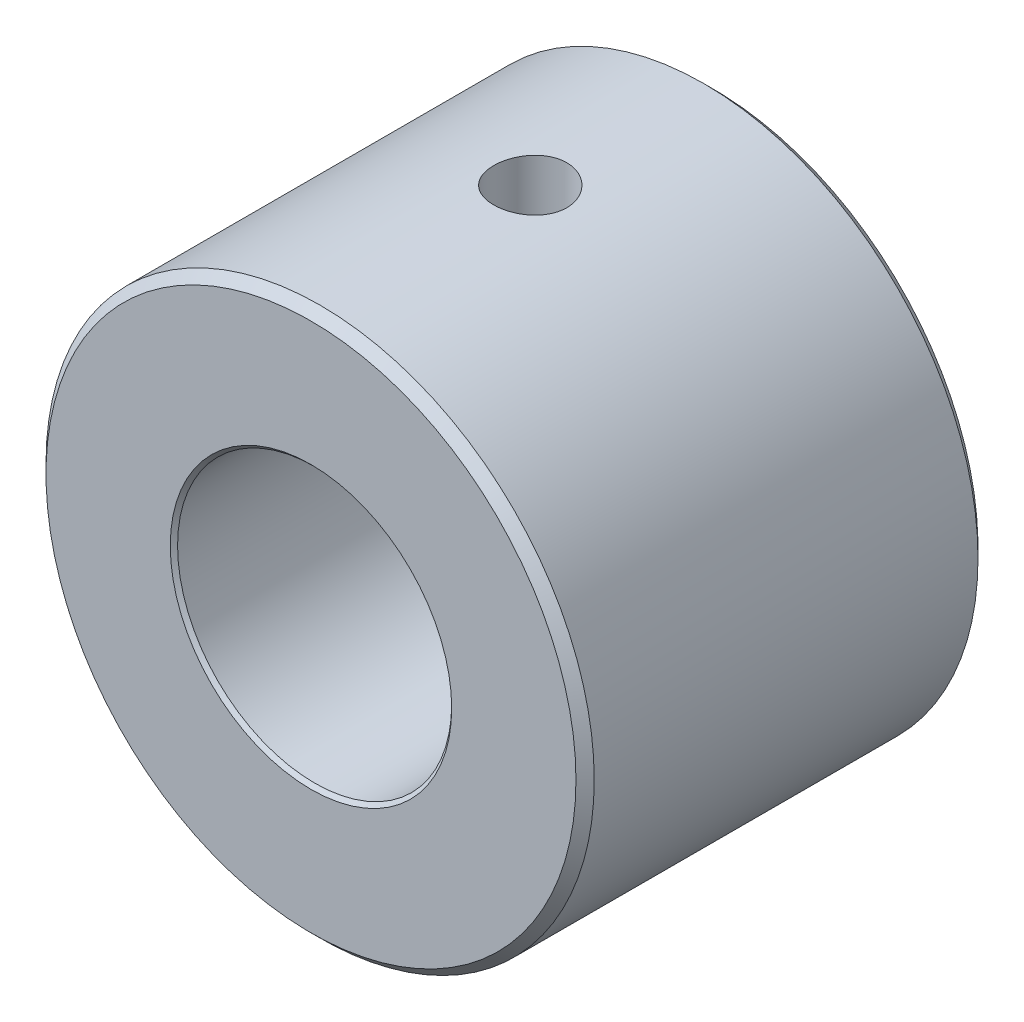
from build123d import *

# Parameters (mm, degrees)
ESQUISSE1_W             = 22
ESQUISSE1_H             = 7.5
CHANFREIN1_SIZE         = 0.2
CHANFREIN2_SIZE         = 0.5
ESQUISSE2_W             = 35.542797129
ESQUISSE2_H             = 10.348455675
ENL_V_MAT_EXTRU_1_DEPTH = 20.1
TROU_TARAUD_M41_REACH   = 35.136
TROU_TARAUD_M41_BORE_R  = 1.65
TROU_TARAUD_M62_REACH   = 37.623
TROU_TARAUD_M62_BORE_R  = 2


with BuildPart() as part:
    # Esquisse1 → R_volution1 (revolve)
    with BuildSketch(Plane(origin=(0, 0, 0), x_dir=(0, 0, -1), z_dir=(1, 0, 0)), mode=Mode.PRIVATE) as r_volution1_sk:
        with Locations((1, 11.25)):
            Rectangle(ESQUISSE1_W, ESQUISSE1_H)
    revolve(r_volution1_sk.sketch.rotate(Axis((0, 0, 0), (0, 0, 1)), 90), axis=Axis((0, 0, 0), (0, 0, 1)))

    # Chanfrein1
    chanfrein1_edges = [part.edges().sort_by_distance(p)[0] for p in [
        (7.5, 0, -12),
        (7.5, 0, 10),
    ]]
    chamfer(chanfrein1_edges, length=CHANFREIN1_SIZE)

    # Chanfrein2
    chanfrein2_edges = [part.edges().sort_by_distance(p)[0] for p in [
        (15, 0, -12),
        (15, 0, 10),
    ]]
    chamfer(chanfrein2_edges, length=CHANFREIN2_SIZE)

    # Esquisse2 → Enl_v. mat.-Extru.1 (cut)
    with BuildSketch(Plane.XY.offset(-12)):
        with Locations((0.458475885, -17.174227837)):
            Rectangle(ESQUISSE2_W, ESQUISSE2_H)
    extrude(amount=ENL_V_MAT_EXTRU_1_DEPTH, mode=Mode.SUBTRACT)

    # Trou taraud_ M41 bore → Trou taraud_ M41 (cut, up to next)
    with BuildSketch(Plane(origin=(0, -12, 0), x_dir=(-1, 0, 0), z_dir=(0, -1, 0)), mode=Mode.PRIVATE) as trou_taraud_m41_sk1:
        with Locations((0, 2)):
            Circle(TROU_TARAUD_M41_BORE_R)
    trou_taraud_m41_tool1 = extrude(trou_taraud_m41_sk1.sketch, amount=-TROU_TARAUD_M41_REACH, mode=Mode.PRIVATE) & part.part
    add(trou_taraud_m41_tool1.solids().sort_by_distance((0, -12, -2))[0], mode=Mode.SUBTRACT)

    # Trou taraud_ M62 bore → Trou taraud_ M62 (cut, up to next)
    with BuildSketch(Plane(origin=(0, 15, 0), x_dir=(1, 0, 0), z_dir=(0, 1, 0)), mode=Mode.PRIVATE) as trou_taraud_m62_sk1:
        with Locations((0, 2)):
            Circle(TROU_TARAUD_M62_BORE_R)
    trou_taraud_m62_tool1 = extrude(trou_taraud_m62_sk1.sketch, amount=-TROU_TARAUD_M62_REACH, mode=Mode.PRIVATE) & part.part
    add(trou_taraud_m62_tool1.solids().sort_by_distance((0, 15, -2))[0], mode=Mode.SUBTRACT)


solid = part.part
